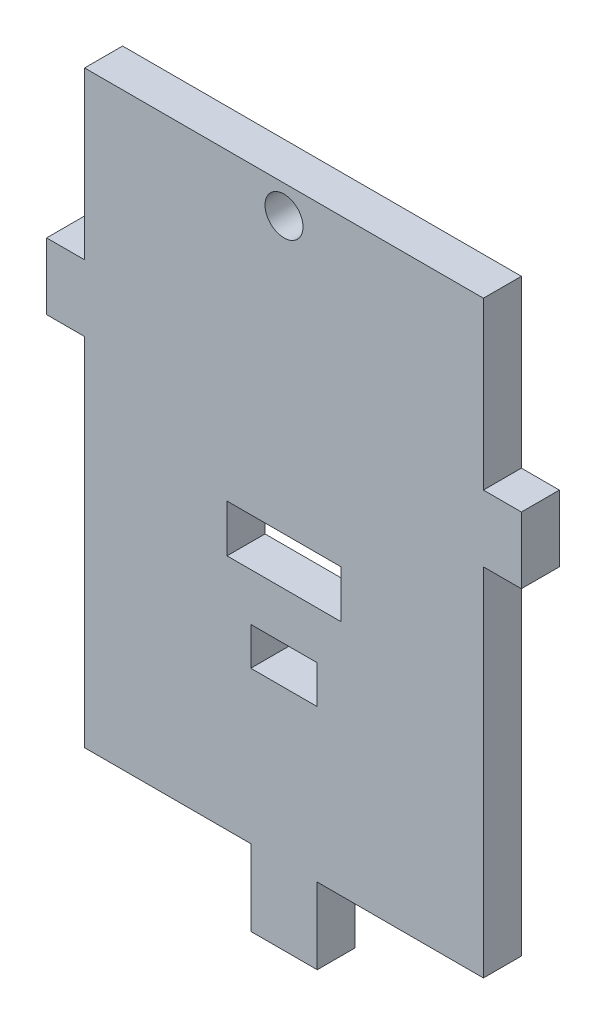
from build123d import *

# Parameters (mm, degrees)
SKETCH1_W           = 4
SKETCH1_H           = 7
SKETCH1_R           = 2
SKETCH1_W_2         = 12
SKETCH1_H_2         = 5
SKETCH1_W_3         = 7
SKETCH1_H_3         = 4
BOSS_EXTRUDE1_DEPTH = 4


with BuildPart() as part:
    # Sketch1 → Boss-Extrude1 (new body)
    # profile 1 of 3: a face of its own
    with BuildSketch(Plane.XY):
        with Locations((24.451113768, -14.36470609)):
            Rectangle(SKETCH1_W, SKETCH1_H)
    # profile 2 of 3: a face of its own
    with BuildSketch(Plane.XY):
        Polygon((-19.548886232, 6.63529391), (22.451113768, 6.63529391), (22.451113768, -55.36470609), (4.951113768, -55.36470609), (4.951113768, -63.36470609), (-2.048886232, -63.36470609), (-2.048886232, -55.36470609), (-19.548886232, -55.36470609), align=None)
        with Locations((1.451113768, 3.63529391)):
            Circle(SKETCH1_R, mode=Mode.SUBTRACT)
        with Locations((1.451113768, -27.86470609)):
            Rectangle(SKETCH1_W_2, SKETCH1_H_2, mode=Mode.SUBTRACT)
        with Locations((1.451113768, -37.36470609)):
            Rectangle(SKETCH1_W_3, SKETCH1_H_3, mode=Mode.SUBTRACT)
    # profile 3 of 3: a face of its own
    with BuildSketch(Plane.XY):
        with Locations((-21.548886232, -14.36470609)):
            Rectangle(SKETCH1_W, SKETCH1_H)
    extrude(amount=BOSS_EXTRUDE1_DEPTH)


solid = part.part
